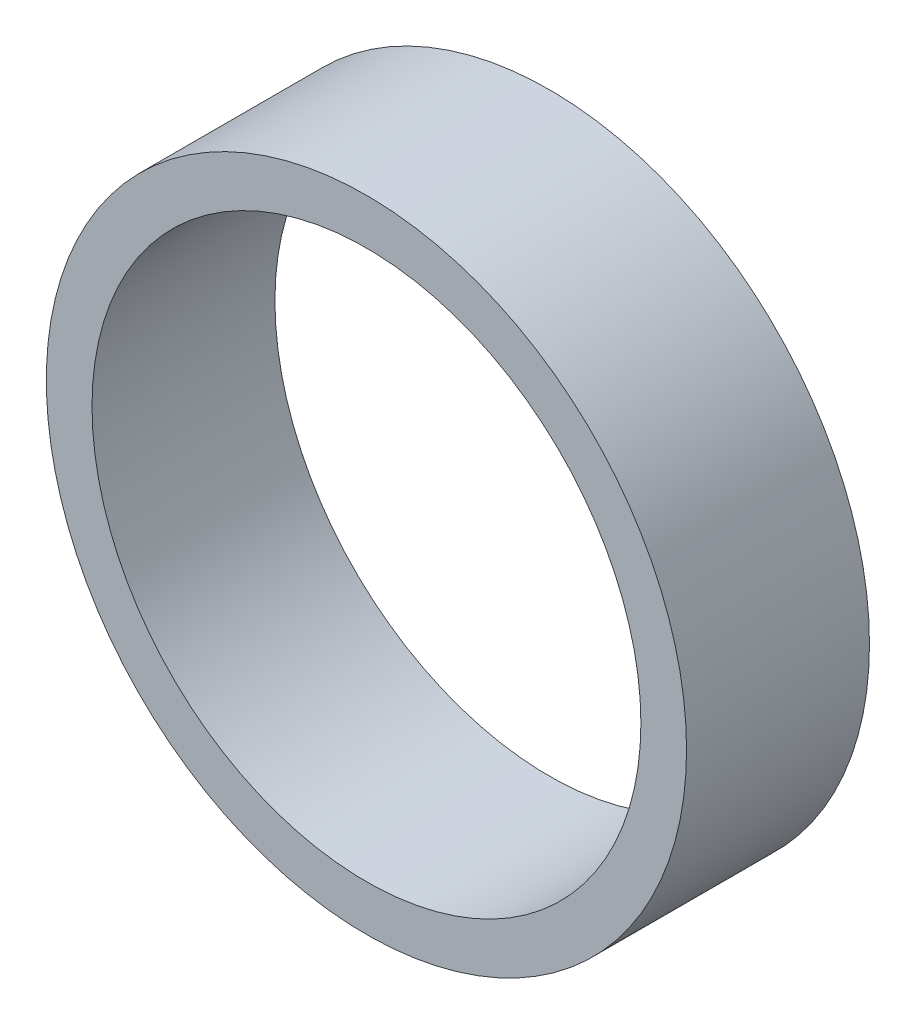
ISO-10303-21;
HEADER;
FILE_DESCRIPTION(('STEP AP214'),'2;1');
FILE_NAME('part.step','',(''),(''),'','','');
FILE_SCHEMA(('AUTOMOTIVE_DESIGN { 1 0 10303 214 1 1 1 1 }'));
ENDSEC;
DATA;
#1=APPLICATION_CONTEXT('core data for automotive mechanical design processes');
#2=APPLICATION_PROTOCOL_DEFINITION('international standard','automotive_design',2000,#1);
#3=PRODUCT_CONTEXT('',#1,'mechanical');
#4=PRODUCT('Part','Part','',(#3));
#5=PRODUCT_RELATED_PRODUCT_CATEGORY('part','',(#4));
#6=PRODUCT_DEFINITION_FORMATION('','',#4);
#7=PRODUCT_DEFINITION_CONTEXT('part definition',#1,'design');
#8=PRODUCT_DEFINITION('design','',#6,#7);
#9=PRODUCT_DEFINITION_SHAPE('','',#8);
#10=(LENGTH_UNIT() NAMED_UNIT(*) SI_UNIT(.MILLI.,.METRE.));
#11=(NAMED_UNIT(*) PLANE_ANGLE_UNIT() SI_UNIT($,.RADIAN.));
#12=(NAMED_UNIT(*) SI_UNIT($,.STERADIAN.) SOLID_ANGLE_UNIT());
#13=UNCERTAINTY_MEASURE_WITH_UNIT(LENGTH_MEASURE(1.E-05),#10,'distance_accuracy_value','');
#14=(GEOMETRIC_REPRESENTATION_CONTEXT(3) GLOBAL_UNCERTAINTY_ASSIGNED_CONTEXT((#13)) GLOBAL_UNIT_ASSIGNED_CONTEXT((#10,
#11,#12)) REPRESENTATION_CONTEXT('',''));
#15=CARTESIAN_POINT('',(0.,0.,0.));
#16=DIRECTION('',(0.,0.,1.));
#17=DIRECTION('',(1.,0.,0.));
#18=AXIS2_PLACEMENT_3D('',#15,#16,#17);
#19=CARTESIAN_POINT('',(0.,0.,76.2));
#20=DIRECTION('',(0.,0.,-1.));
#21=DIRECTION('',(-1.,0.,0.));
#22=AXIS2_PLACEMENT_3D('',#19,#20,#21);
#23=CYLINDRICAL_SURFACE('',#22,133.35);
#24=CARTESIAN_POINT('',(0.,0.,76.2));
#25=DIRECTION('',(0.,0.,1.));
#26=DIRECTION('',(1.,0.,0.));
#27=AXIS2_PLACEMENT_3D('',#24,#25,#26);
#28=CIRCLE('',#27,133.35);
#29=CARTESIAN_POINT('',(133.35,0.,76.2));
#30=VERTEX_POINT('',#29);
#31=EDGE_CURVE('E10',#30,#30,#28,.T.);
#32=ORIENTED_EDGE('',*,*,#31,.F.);
#33=EDGE_LOOP('',(#32));
#34=FACE_BOUND('',#33,.T.);
#35=CARTESIAN_POINT('',(0.,0.,0.));
#36=DIRECTION('',(0.,0.,1.));
#37=DIRECTION('',(1.,0.,0.));
#38=AXIS2_PLACEMENT_3D('',#35,#36,#37);
#39=CIRCLE('',#38,133.35);
#40=CARTESIAN_POINT('',(133.35,0.,0.));
#41=VERTEX_POINT('',#40);
#42=EDGE_CURVE('E44',#41,#41,#39,.T.);
#43=ORIENTED_EDGE('',*,*,#42,.T.);
#44=EDGE_LOOP('',(#43));
#45=FACE_BOUND('',#44,.T.);
#46=ADVANCED_FACE('F41',(#34,#45),#23,.T.);
#47=CARTESIAN_POINT('',(0.,0.,76.2));
#48=DIRECTION('',(0.,0.,1.));
#49=DIRECTION('',(1.,0.,0.));
#50=AXIS2_PLACEMENT_3D('',#47,#48,#49);
#51=PLANE('',#50);
#52=CARTESIAN_POINT('',(0.,0.,76.2));
#53=DIRECTION('',(0.,0.,1.));
#54=DIRECTION('',(1.,0.,0.));
#55=AXIS2_PLACEMENT_3D('',#52,#53,#54);
#56=CIRCLE('',#55,114.3254);
#57=CARTESIAN_POINT('',(114.3254,0.,76.2));
#58=VERTEX_POINT('',#57);
#59=EDGE_CURVE('E51',#58,#58,#56,.T.);
#60=ORIENTED_EDGE('',*,*,#59,.F.);
#61=EDGE_LOOP('',(#60));
#62=FACE_BOUND('',#61,.T.);
#63=ORIENTED_EDGE('',*,*,#31,.T.);
#64=EDGE_LOOP('',(#63));
#65=FACE_BOUND('',#64,.T.);
#66=ADVANCED_FACE('F62',(#62,#65),#51,.T.);
#67=CARTESIAN_POINT('',(0.,0.,0.));
#68=DIRECTION('',(0.,0.,1.));
#69=DIRECTION('',(1.,0.,0.));
#70=AXIS2_PLACEMENT_3D('',#67,#68,#69);
#71=PLANE('',#70);
#72=CARTESIAN_POINT('',(0.,0.,0.));
#73=DIRECTION('',(0.,0.,1.));
#74=DIRECTION('',(1.,0.,0.));
#75=AXIS2_PLACEMENT_3D('',#72,#73,#74);
#76=CIRCLE('',#75,114.3254);
#77=CARTESIAN_POINT('',(114.3254,0.,0.));
#78=VERTEX_POINT('',#77);
#79=EDGE_CURVE('E53',#78,#78,#76,.T.);
#80=ORIENTED_EDGE('',*,*,#79,.T.);
#81=EDGE_LOOP('',(#80));
#82=FACE_BOUND('',#81,.T.);
#83=ORIENTED_EDGE('',*,*,#42,.F.);
#84=EDGE_LOOP('',(#83));
#85=FACE_BOUND('',#84,.T.);
#86=ADVANCED_FACE('F64',(#82,#85),#71,.F.);
#87=CARTESIAN_POINT('',(0.,0.,76.2));
#88=DIRECTION('',(0.,0.,-1.));
#89=DIRECTION('',(-1.,0.,0.));
#90=AXIS2_PLACEMENT_3D('',#87,#88,#89);
#91=CYLINDRICAL_SURFACE('',#90,114.3254);
#92=ORIENTED_EDGE('',*,*,#59,.T.);
#93=EDGE_LOOP('',(#92));
#94=FACE_BOUND('',#93,.T.);
#95=ORIENTED_EDGE('',*,*,#79,.F.);
#96=EDGE_LOOP('',(#95));
#97=FACE_BOUND('',#96,.T.);
#98=ADVANCED_FACE('F59',(#94,#97),#91,.F.);
#99=CLOSED_SHELL('',(#46,#66,#86,#98));
#100=MANIFOLD_SOLID_BREP('B2',#99);
#101=ADVANCED_BREP_SHAPE_REPRESENTATION('',(#18,#100),#14);
#102=SHAPE_DEFINITION_REPRESENTATION(#9,#101);
ENDSEC;
END-ISO-10303-21;
